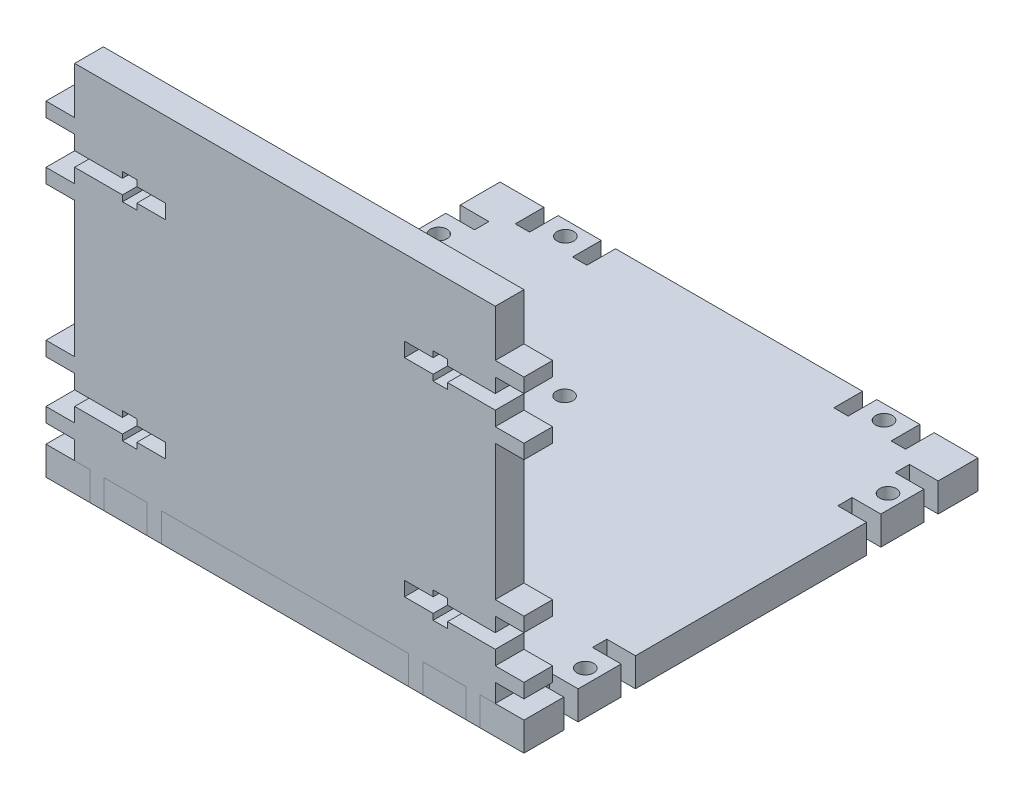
from build123d import *

# Parameters (mm, degrees)
SKETCH1_W           = 100
SKETCH1_H           = 95
BOSS_EXTRUDE1_DEPTH = 6
SKETCH2_R           = 1.75
SKETCH2_W           = 6
SKETCH2_H           = 3
SKETCH2_W_2         = 3
SKETCH2_H_2         = 6
CUT_EXTRUDE1_DEPTH  = 70.226078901
SKETCH3_R           = 11.5
SKETCH3_R_2         = 1.75
CUT_EXTRUDE2_DEPTH  = 70.226078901
BOSS_EXTRUDE2_DEPTH = 6
SKETCH5_W           = 6
SKETCH5_H           = 3
BOSS_EXTRUDE4_DEPTH = 6
CUT_EXTRUDE3_DEPTH  = 133.698907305


with BuildPart() as part:
    # Sketch1 → Boss-Extrude1 (new body)
    with BuildSketch(Plane(origin=(0, 0, 0), x_dir=(1, 0, 0), z_dir=(0, 1, 0))):
        Rectangle(SKETCH1_W, SKETCH1_H)
    extrude(amount=BOSS_EXTRUDE1_DEPTH)

    # Sketch2 → Cut-Extrude1 (cut, through all)
    with BuildSketch(Plane(origin=(0, 6, 0), x_dir=(1, 0, 0), z_dir=(0, 1, 0))):
        with Locations(Location((-33.333333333, 44.5, 0), (0, 0, 270))):
            Circle(SKETCH2_R)
        with Locations(Location((-47, 31.666666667, 0), (0, 0, 270))):
            Circle(SKETCH2_R)
        with Locations(Location((47, 31.666666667, 0), (0, 0, 90))):
            Circle(SKETCH2_R)
        with Locations(Location((33.333333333, 44.5, 0), (0, 0, 90))):
            Circle(SKETCH2_R)
        with Locations(Location((47, -31.666666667, 0), (0, 0, 270))):
            Circle(SKETCH2_R)
        with Locations(Location((33.333333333, -44.5, 0), (0, 0, 270))):
            Circle(SKETCH2_R)
        with Locations(Location((-47, -31.666666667, 0), (0, 0, 90))):
            Circle(SKETCH2_R)
        with Locations(Location((-33.333333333, -44.5, 0), (0, 0, 90))):
            Circle(SKETCH2_R)
        with Locations((-47, 37.666666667)):
            Rectangle(SKETCH2_W, SKETCH2_H)
        with Locations((-39.333333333, 44.5)):
            Rectangle(SKETCH2_W_2, SKETCH2_H_2)
        with Locations((-27.333333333, 44.5)):
            Rectangle(SKETCH2_W_2, SKETCH2_H_2)
        with Locations((-47, 25.666666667)):
            Rectangle(SKETCH2_W, SKETCH2_H)
        with Locations((47, 25.666666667)):
            Rectangle(SKETCH2_W, SKETCH2_H)
        with Locations((47, 37.666666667)):
            Rectangle(SKETCH2_W, SKETCH2_H)
        with Locations((39.333333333, 44.5)):
            Rectangle(SKETCH2_W_2, SKETCH2_H_2)
        with Locations((27.333333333, 44.5)):
            Rectangle(SKETCH2_W_2, SKETCH2_H_2)
        with Locations((47, -25.666666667)):
            Rectangle(SKETCH2_W, SKETCH2_H)
        with Locations((47, -37.666666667)):
            Rectangle(SKETCH2_W, SKETCH2_H)
        with Locations((39.333333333, -44.5)):
            Rectangle(SKETCH2_W_2, SKETCH2_H_2)
        with Locations((27.333333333, -44.5)):
            Rectangle(SKETCH2_W_2, SKETCH2_H_2)
        with Locations((-47, -25.666666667)):
            Rectangle(SKETCH2_W, SKETCH2_H)
        with Locations((-47, -37.666666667)):
            Rectangle(SKETCH2_W, SKETCH2_H)
        with Locations((-39.333333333, -44.5)):
            Rectangle(SKETCH2_W_2, SKETCH2_H_2)
        with Locations((-27.333333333, -44.5)):
            Rectangle(SKETCH2_W_2, SKETCH2_H_2)
    extrude(amount=-CUT_EXTRUDE1_DEPTH, mode=Mode.SUBTRACT)

    # Sketch3 → Cut-Extrude2 (cut, through all)
    with BuildSketch(Plane(origin=(0, 6, 0), x_dir=(1, 0, 0), z_dir=(0, 1, 0))):
        with Locations(Location((-20, 0, 0), (0, 0, 270))):
            Circle(SKETCH3_R)
        with Locations(Location((-4.5, 15.5, 0), (0, 0, 270))):
            Circle(SKETCH3_R_2)
        with Locations(Location((-35.5, 15.5, 0), (0, 0, 270))):
            Circle(SKETCH3_R_2)
        with Locations(Location((-35.5, -15.5, 0), (0, 0, 90))):
            Circle(SKETCH3_R_2)
        with Locations(Location((-4.5, -15.5, 0), (0, 0, 90))):
            Circle(SKETCH3_R_2)
    extrude(amount=-CUT_EXTRUDE2_DEPTH, mode=Mode.SUBTRACT)


with BuildPart() as body_2:
    # Sketch4 → Boss-Extrude2 (new body)
    with BuildSketch(Plane.XY.offset(41.5)):
        Polygon((40.833333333, 0), (40.833333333, 6), (44, 6), (44, 78), (-44, 78), (-44, 6), (-40.833333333, 6), (-40.833333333, 0), (-37.833333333, 0), (-37.833333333, 6), (-28.833333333, 6), (-28.833333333, 0), (-25.833333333, 0), (-25.833333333, 6), (25.833333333, 6), (25.833333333, 0), (28.833333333, 0), (28.833333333, 6), (37.833333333, 6), (37.833333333, 0), align=None)
    extrude(amount=BOSS_EXTRUDE2_DEPTH)

    # Sketch5 → Boss-Extrude4 (add)
    with BuildSketch(Plane.XY.offset(47.5)):
        with Locations((-47, 66.666666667)):
            Rectangle(SKETCH5_W, SKETCH5_H)
        with Locations((-47, 54.666666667)):
            Rectangle(SKETCH5_W, SKETCH5_H)
        with Locations((-47, 23.333333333)):
            Rectangle(SKETCH5_W, SKETCH5_H)
        with Locations((-47, 11.333333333)):
            Rectangle(SKETCH5_W, SKETCH5_H)
        with Locations((47, 11.333333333)):
            Rectangle(SKETCH5_W, SKETCH5_H)
        with Locations((47, 23.333333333)):
            Rectangle(SKETCH5_W, SKETCH5_H)
        with Locations((47, 54.666666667)):
            Rectangle(SKETCH5_W, SKETCH5_H)
        with Locations((47, 66.666666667)):
            Rectangle(SKETCH5_W, SKETCH5_H)
    extrude(amount=-BOSS_EXTRUDE4_DEPTH)

    # Sketch6 → Cut-Extrude3 (cut, through all)
    with BuildSketch(Plane.XY.offset(47.5)):
        Polygon((-44, 62.166666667), (-34, 62.166666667), (-34, 63.422566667), (-31, 63.422566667), (-31, 62.166666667), (-25, 62.166666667), (-25, 59.166666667), (-31, 59.166666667), (-31, 57.910766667), (-34, 57.910766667), (-34, 59.166666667), (-44, 59.166666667), align=None)
        Polygon((31, 59.166666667), (25, 59.166666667), (25, 62.166666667), (31, 62.166666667), (31, 63.422566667), (34, 63.422566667), (34, 62.166666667), (44, 62.166666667), (44, 59.166666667), (34, 59.166666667), (34, 57.910766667), (31, 57.910766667), align=None)
        Polygon((-31, 18.833333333), (-25, 18.833333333), (-25, 15.833333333), (-31, 15.833333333), (-31, 14.577433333), (-34, 14.577433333), (-34, 15.833333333), (-44, 15.833333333), (-44, 18.833333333), (-34, 18.833333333), (-34, 20.089233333), (-31, 20.089233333), align=None)
        Polygon((31, 18.833333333), (31, 20.089233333), (34, 20.089233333), (34, 18.833333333), (44, 18.833333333), (44, 15.833333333), (34, 15.833333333), (34, 14.577433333), (31, 14.577433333), (31, 15.833333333), (25, 15.833333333), (25, 18.833333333), align=None)
    extrude(amount=-CUT_EXTRUDE3_DEPTH, mode=Mode.SUBTRACT)


solid = Compound([part.part, body_2.part])
